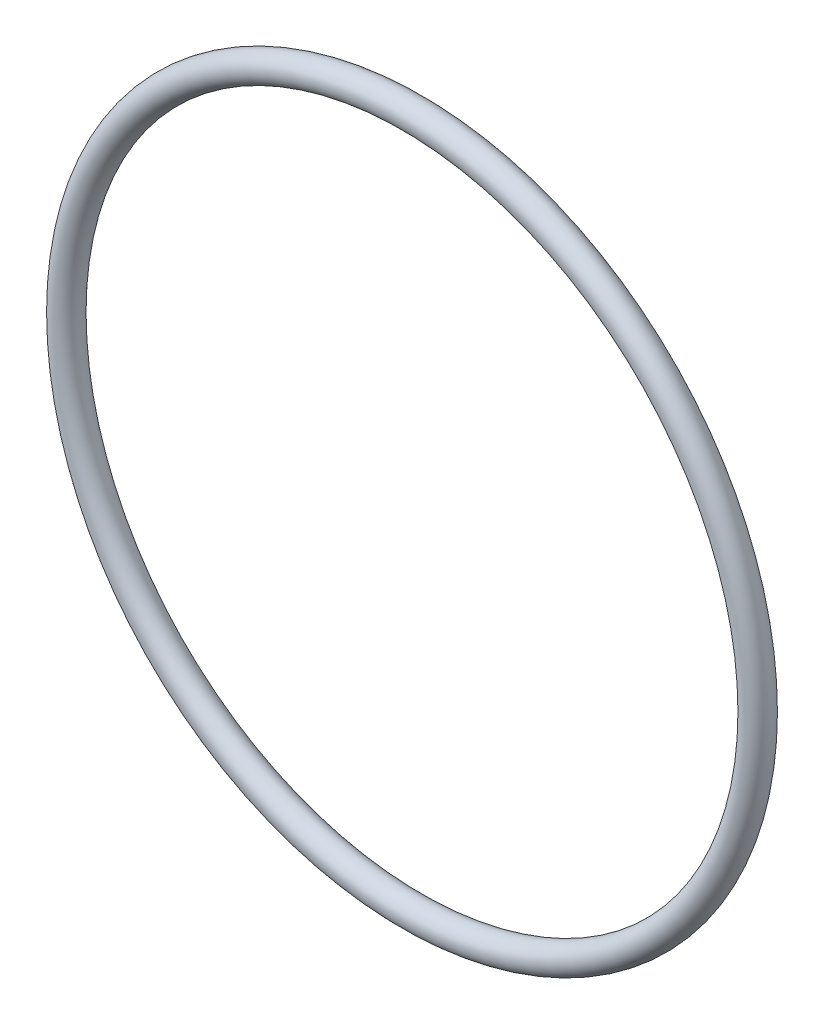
ISO-10303-21;
HEADER;
FILE_DESCRIPTION(('STEP AP214'),'2;1');
FILE_NAME('part.step','',(''),(''),'','','');
FILE_SCHEMA(('AUTOMOTIVE_DESIGN { 1 0 10303 214 1 1 1 1 }'));
ENDSEC;
DATA;
#1=APPLICATION_CONTEXT('core data for automotive mechanical design processes');
#2=APPLICATION_PROTOCOL_DEFINITION('international standard','automotive_design',2000,#1);
#3=PRODUCT_CONTEXT('',#1,'mechanical');
#4=PRODUCT('Part','Part','',(#3));
#5=PRODUCT_RELATED_PRODUCT_CATEGORY('part','',(#4));
#6=PRODUCT_DEFINITION_FORMATION('','',#4);
#7=PRODUCT_DEFINITION_CONTEXT('part definition',#1,'design');
#8=PRODUCT_DEFINITION('design','',#6,#7);
#9=PRODUCT_DEFINITION_SHAPE('','',#8);
#10=(LENGTH_UNIT() NAMED_UNIT(*) SI_UNIT(.MILLI.,.METRE.));
#11=(NAMED_UNIT(*) PLANE_ANGLE_UNIT() SI_UNIT($,.RADIAN.));
#12=(NAMED_UNIT(*) SI_UNIT($,.STERADIAN.) SOLID_ANGLE_UNIT());
#13=UNCERTAINTY_MEASURE_WITH_UNIT(LENGTH_MEASURE(1.E-05),#10,'distance_accuracy_value','');
#14=(GEOMETRIC_REPRESENTATION_CONTEXT(3) GLOBAL_UNCERTAINTY_ASSIGNED_CONTEXT((#13)) GLOBAL_UNIT_ASSIGNED_CONTEXT((#10,
#11,#12)) REPRESENTATION_CONTEXT('',''));
#15=CARTESIAN_POINT('',(0.,0.,0.));
#16=DIRECTION('',(0.,0.,1.));
#17=DIRECTION('',(1.,0.,0.));
#18=AXIS2_PLACEMENT_3D('',#15,#16,#17);
#19=CARTESIAN_POINT('',(0.,-53.5,-63.));
#20=DIRECTION('',(0.,0.,1.));
#21=DIRECTION('',(1.,0.,0.));
#22=AXIS2_PLACEMENT_3D('',#19,#20,#21);
#23=TOROIDAL_SURFACE('',#22,49.5,2.);
#24=ADVANCED_FACE('F13',(),#23,.T.);
#25=CLOSED_SHELL('',(#24));
#26=MANIFOLD_SOLID_BREP('B1',#25);
#27=ADVANCED_BREP_SHAPE_REPRESENTATION('',(#18,#26),#14);
#28=SHAPE_DEFINITION_REPRESENTATION(#9,#27);
ENDSEC;
END-ISO-10303-21;
